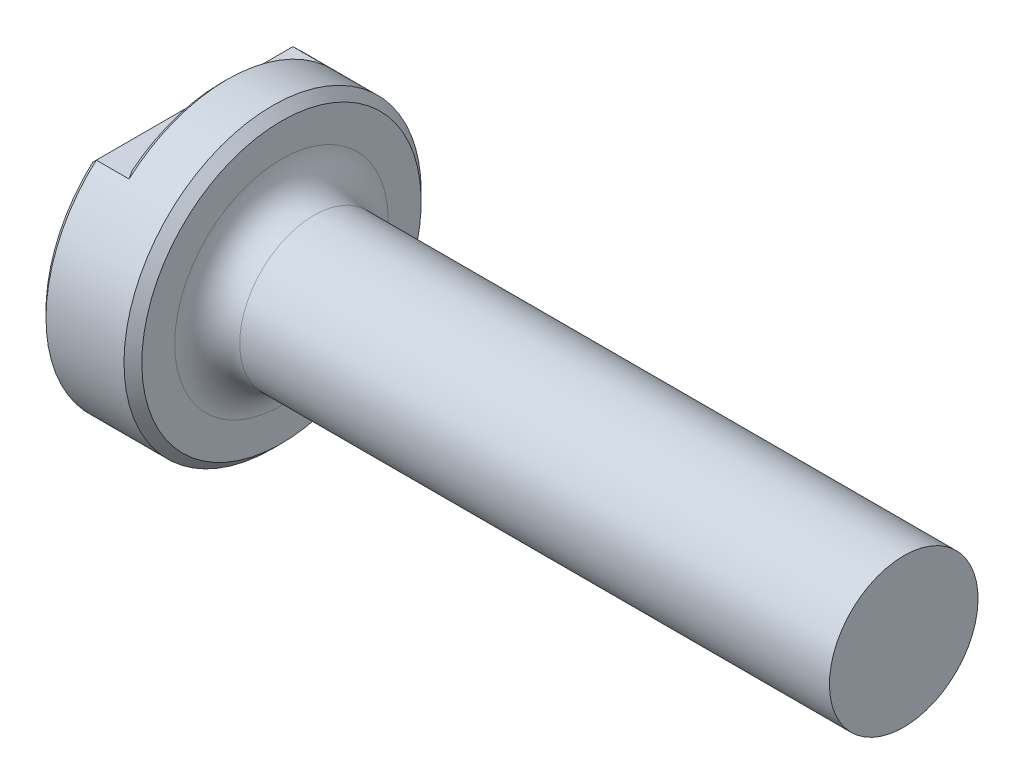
ISO-10303-21;
HEADER;
FILE_DESCRIPTION(('STEP AP214'),'2;1');
FILE_NAME('part.step','',(''),(''),'','','');
FILE_SCHEMA(('AUTOMOTIVE_DESIGN { 1 0 10303 214 1 1 1 1 }'));
ENDSEC;
DATA;
#1=APPLICATION_CONTEXT('core data for automotive mechanical design processes');
#2=APPLICATION_PROTOCOL_DEFINITION('international standard','automotive_design',2000,#1);
#3=PRODUCT_CONTEXT('',#1,'mechanical');
#4=PRODUCT('Part','Part','',(#3));
#5=PRODUCT_RELATED_PRODUCT_CATEGORY('part','',(#4));
#6=PRODUCT_DEFINITION_FORMATION('','',#4);
#7=PRODUCT_DEFINITION_CONTEXT('part definition',#1,'design');
#8=PRODUCT_DEFINITION('design','',#6,#7);
#9=PRODUCT_DEFINITION_SHAPE('','',#8);
#10=(LENGTH_UNIT() NAMED_UNIT(*) SI_UNIT(.MILLI.,.METRE.));
#11=(NAMED_UNIT(*) PLANE_ANGLE_UNIT() SI_UNIT($,.RADIAN.));
#12=(NAMED_UNIT(*) SI_UNIT($,.STERADIAN.) SOLID_ANGLE_UNIT());
#13=UNCERTAINTY_MEASURE_WITH_UNIT(LENGTH_MEASURE(1.E-05),#10,'distance_accuracy_value','');
#14=(GEOMETRIC_REPRESENTATION_CONTEXT(3) GLOBAL_UNCERTAINTY_ASSIGNED_CONTEXT((#13)) GLOBAL_UNIT_ASSIGNED_CONTEXT((#10,
#11,#12)) REPRESENTATION_CONTEXT('',''));
#15=CARTESIAN_POINT('',(0.,0.,0.));
#16=DIRECTION('',(0.,0.,1.));
#17=DIRECTION('',(1.,0.,0.));
#18=AXIS2_PLACEMENT_3D('',#15,#16,#17);
#19=CARTESIAN_POINT('',(-61.11875,0.,0.));
#20=DIRECTION('',(1.,0.,0.));
#21=DIRECTION('',(0.,0.,-1.));
#22=AXIS2_PLACEMENT_3D('',#19,#20,#21);
#23=PLANE('',#22);
#24=CARTESIAN_POINT('',(-61.11875,0.,0.));
#25=DIRECTION('',(1.,0.,0.));
#26=DIRECTION('',(0.,0.,-1.));
#27=AXIS2_PLACEMENT_3D('',#24,#25,#26);
#28=CIRCLE('',#27,24.384);
#29=CARTESIAN_POINT('',(-61.11875,18.034,-16.4120169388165));
#30=VERTEX_POINT('',#29);
#31=CARTESIAN_POINT('',(-61.11875,18.034,16.4120169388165));
#32=VERTEX_POINT('',#31);
#33=EDGE_CURVE('E52',#30,#32,#28,.F.);
#34=ORIENTED_EDGE('',*,*,#33,.T.);
#35=DIRECTION('',(0.,0.,-1.));
#36=VECTOR('',#35,1.);
#37=CARTESIAN_POINT('',(-61.11875,18.034,0.));
#38=LINE('',#37,#36);
#39=EDGE_CURVE('E126',#32,#30,#38,.T.);
#40=ORIENTED_EDGE('',*,*,#39,.T.);
#41=EDGE_LOOP('',(#34,#40));
#42=FACE_BOUND('',#41,.T.);
#43=CARTESIAN_POINT('',(-61.11875,0.,0.));
#44=DIRECTION('',(1.,0.,0.));
#45=DIRECTION('',(0.,1.,0.));
#46=AXIS2_PLACEMENT_3D('',#43,#44,#45);
#47=CIRCLE('',#46,12.4401929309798);
#48=CARTESIAN_POINT('',(-61.11875,12.4401929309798,0.));
#49=VERTEX_POINT('',#48);
#50=EDGE_CURVE('E106',#49,#49,#47,.T.);
#51=ORIENTED_EDGE('',*,*,#50,.T.);
#52=EDGE_LOOP('',(#51));
#53=FACE_BOUND('',#52,.T.);
#54=ADVANCED_FACE('F32',(#42,#53),#23,.F.);
#55=CARTESIAN_POINT('',(61.11875,0.,0.));
#56=DIRECTION('',(-1.,0.,0.));
#57=DIRECTION('',(0.,0.,1.));
#58=AXIS2_PLACEMENT_3D('',#55,#56,#57);
#59=CYLINDRICAL_SURFACE('',#58,25.4);
#60=CARTESIAN_POINT('',(-46.76775,0.,0.));
#61=DIRECTION('',(1.,0.,0.));
#62=DIRECTION('',(0.,0.,-1.));
#63=AXIS2_PLACEMENT_3D('',#60,#61,#62);
#64=CIRCLE('',#63,25.4);
#65=CARTESIAN_POINT('',(-46.76775,0.,-25.4));
#66=VERTEX_POINT('',#65);
#67=EDGE_CURVE('E97',#66,#66,#64,.F.);
#68=ORIENTED_EDGE('',*,*,#67,.T.);
#69=EDGE_LOOP('',(#68));
#70=FACE_BOUND('',#69,.T.);
#71=DIRECTION('',(-1.,0.,0.));
#72=VECTOR('',#71,1.);
#73=CARTESIAN_POINT('',(61.11875,19.05,-16.8005208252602));
#74=LINE('',#73,#72);
#75=CARTESIAN_POINT('',(-60.10275,19.05,-16.8005208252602));
#76=VERTEX_POINT('',#75);
#77=CARTESIAN_POINT('',(-54.51475,19.05,-16.8005208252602));
#78=VERTEX_POINT('',#77);
#79=EDGE_CURVE('E100',#76,#78,#74,.F.);
#80=ORIENTED_EDGE('',*,*,#79,.T.);
#81=CARTESIAN_POINT('',(-54.51475,0.,0.));
#82=DIRECTION('',(-1.,0.,0.));
#83=DIRECTION('',(0.,0.,1.));
#84=AXIS2_PLACEMENT_3D('',#81,#82,#83);
#85=CIRCLE('',#84,25.4);
#86=CARTESIAN_POINT('',(-54.51475,19.05,16.8005208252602));
#87=VERTEX_POINT('',#86);
#88=EDGE_CURVE('E86',#78,#87,#85,.F.);
#89=ORIENTED_EDGE('',*,*,#88,.T.);
#90=DIRECTION('',(-1.,0.,0.));
#91=VECTOR('',#90,1.);
#92=CARTESIAN_POINT('',(61.11875,19.05,16.8005208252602));
#93=LINE('',#92,#91);
#94=CARTESIAN_POINT('',(-60.10275,19.05,16.8005208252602));
#95=VERTEX_POINT('',#94);
#96=EDGE_CURVE('E103',#87,#95,#93,.T.);
#97=ORIENTED_EDGE('',*,*,#96,.T.);
#98=CARTESIAN_POINT('',(-60.10275,0.,0.));
#99=DIRECTION('',(1.,0.,0.));
#100=DIRECTION('',(0.,0.,-1.));
#101=AXIS2_PLACEMENT_3D('',#98,#99,#100);
#102=CIRCLE('',#101,25.4);
#103=EDGE_CURVE('E96',#95,#76,#102,.T.);
#104=ORIENTED_EDGE('',*,*,#103,.T.);
#105=EDGE_LOOP('',(#80,#89,#97,#104));
#106=FACE_BOUND('',#105,.T.);
#107=ADVANCED_FACE('F173',(#70,#106),#59,.T.);
#108=CARTESIAN_POINT('',(-55.53075,0.,0.));
#109=DIRECTION('',(-1.,0.,0.));
#110=DIRECTION('',(0.,0.,1.));
#111=AXIS2_PLACEMENT_3D('',#108,#109,#110);
#112=PLANE('',#111);
#113=DIRECTION('',(0.,0.,1.));
#114=VECTOR('',#113,1.);
#115=CARTESIAN_POINT('',(-55.53075,19.05,-25.4));
#116=LINE('',#115,#114);
#117=CARTESIAN_POINT('',(-55.53075,19.05,-15.2209380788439));
#118=VERTEX_POINT('',#117);
#119=CARTESIAN_POINT('',(-55.53075,19.05,15.2209380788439));
#120=VERTEX_POINT('',#119);
#121=EDGE_CURVE('E95',#118,#120,#116,.T.);
#122=ORIENTED_EDGE('',*,*,#121,.T.);
#123=CARTESIAN_POINT('',(-55.53075,0.,0.));
#124=DIRECTION('',(-1.,0.,0.));
#125=DIRECTION('',(0.,0.,1.));
#126=AXIS2_PLACEMENT_3D('',#123,#124,#125);
#127=CIRCLE('',#126,24.384);
#128=EDGE_CURVE('E84',#120,#118,#127,.T.);
#129=ORIENTED_EDGE('',*,*,#128,.T.);
#130=EDGE_LOOP('',(#122,#129));
#131=FACE_BOUND('',#130,.T.);
#132=ADVANCED_FACE('F94',(#131),#112,.T.);
#133=CARTESIAN_POINT('',(-55.53075,19.05,-25.4));
#134=DIRECTION('',(0.,-1.,0.));
#135=DIRECTION('',(0.,0.,-1.));
#136=AXIS2_PLACEMENT_3D('',#133,#134,#135);
#137=PLANE('',#136);
#138=ORIENTED_EDGE('',*,*,#79,.F.);
#139=DIRECTION('',(0.,0.,1.));
#140=VECTOR('',#139,1.);
#141=CARTESIAN_POINT('',(-60.10275,19.05,-25.4));
#142=LINE('',#141,#140);
#143=EDGE_CURVE('E90',#76,#95,#142,.T.);
#144=ORIENTED_EDGE('',*,*,#143,.T.);
#145=ORIENTED_EDGE('',*,*,#96,.F.);
#146=CARTESIAN_POINT('',(-54.51475,19.05,16.8005208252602));
#147=CARTESIAN_POINT('',(-54.6010969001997,19.05,16.6699759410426));
#148=CARTESIAN_POINT('',(-54.687050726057,19.05,16.5391707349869));
#149=CARTESIAN_POINT('',(-54.8581291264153,19.05,16.2770272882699));
#150=CARTESIAN_POINT('',(-54.9432537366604,19.05,16.1456890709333));
#151=CARTESIAN_POINT('',(-55.1126383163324,19.05,15.8824555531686));
#152=CARTESIAN_POINT('',(-55.1968982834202,19.05,15.7505602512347));
#153=CARTESIAN_POINT('',(-55.3645140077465,19.05,15.4861884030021));
#154=CARTESIAN_POINT('',(-55.4478697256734,19.05,15.3537118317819));
#155=CARTESIAN_POINT('',(-55.53075,19.05,15.2209380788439));
#156=B_SPLINE_CURVE_WITH_KNOTS('',3,(#146,#147,#148,#149,#150,#151,#152,#153,#154,#155),
.UNSPECIFIED.,.F.,.F.,(4,2,2,2,4),(0.,0.46955243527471,0.939084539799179,1.40861791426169,
1.87817162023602),.UNSPECIFIED.);
#157=EDGE_CURVE('E11',#87,#120,#156,.T.);
#158=ORIENTED_EDGE('',*,*,#157,.T.);
#159=ORIENTED_EDGE('',*,*,#121,.F.);
#160=CARTESIAN_POINT('',(-55.53075,19.05,-15.2209380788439));
#161=CARTESIAN_POINT('',(-55.4478697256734,19.05,-15.3537118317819));
#162=CARTESIAN_POINT('',(-55.3645140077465,19.05,-15.4861884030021));
#163=CARTESIAN_POINT('',(-55.1968982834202,19.05,-15.7505602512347));
#164=CARTESIAN_POINT('',(-55.1126383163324,19.05,-15.8824555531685));
#165=CARTESIAN_POINT('',(-54.9432537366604,19.05,-16.1456890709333));
#166=CARTESIAN_POINT('',(-54.8581291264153,19.05,-16.2770272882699));
#167=CARTESIAN_POINT('',(-54.687050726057,19.05,-16.5391707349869));
#168=CARTESIAN_POINT('',(-54.6010969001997,19.05,-16.6699759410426));
#169=CARTESIAN_POINT('',(-54.51475,19.05,-16.8005208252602));
#170=B_SPLINE_CURVE_WITH_KNOTS('',3,(#160,#161,#162,#163,#164,#165,#166,#167,#168,#169),
.UNSPECIFIED.,.F.,.F.,(4,2,2,2,4),(0.,0.46955370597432,0.939087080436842,1.40861918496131,
1.87817162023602),.UNSPECIFIED.);
#171=EDGE_CURVE('E45',#118,#78,#170,.T.);
#172=ORIENTED_EDGE('',*,*,#171,.T.);
#173=EDGE_LOOP('',(#138,#144,#145,#158,#159,#172));
#174=FACE_BOUND('',#173,.T.);
#175=ADVANCED_FACE('F99',(#174),#137,.F.);
#176=CARTESIAN_POINT('',(-45.24375,-25.4,0.));
#177=DIRECTION('',(1.,0.,0.));
#178=DIRECTION('',(0.,1.,0.));
#179=AXIS2_PLACEMENT_3D('',#176,#177,#178);
#180=PLANE('',#179);
#181=CARTESIAN_POINT('',(-45.24375,0.,0.));
#182=DIRECTION('',(1.,0.,0.));
#183=DIRECTION('',(0.,1.,0.));
#184=AXIS2_PLACEMENT_3D('',#181,#182,#183);
#185=CIRCLE('',#184,23.876);
#186=CARTESIAN_POINT('',(-45.24375,23.876,0.));
#187=VERTEX_POINT('',#186);
#188=EDGE_CURVE('E118',#187,#187,#185,.T.);
#189=ORIENTED_EDGE('',*,*,#188,.T.);
#190=EDGE_LOOP('',(#189));
#191=FACE_BOUND('',#190,.T.);
#192=CARTESIAN_POINT('',(-45.24375,0.,0.));
#193=DIRECTION('',(1.,0.,0.));
#194=DIRECTION('',(0.,1.,0.));
#195=AXIS2_PLACEMENT_3D('',#192,#193,#194);
#196=CIRCLE('',#195,18.25625);
#197=CARTESIAN_POINT('',(-45.24375,18.25625,0.));
#198=VERTEX_POINT('',#197);
#199=EDGE_CURVE('E115',#198,#198,#196,.F.);
#200=ORIENTED_EDGE('',*,*,#199,.T.);
#201=EDGE_LOOP('',(#200));
#202=FACE_BOUND('',#201,.T.);
#203=ADVANCED_FACE('F217',(#191,#202),#180,.T.);
#204=CARTESIAN_POINT('',(61.11875,0.,0.));
#205=DIRECTION('',(1.,0.,0.));
#206=DIRECTION('',(0.,1.,0.));
#207=AXIS2_PLACEMENT_3D('',#204,#205,#206);
#208=CYLINDRICAL_SURFACE('',#207,12.7);
#209=CARTESIAN_POINT('',(-39.6875,0.,0.));
#210=DIRECTION('',(1.,0.,0.));
#211=DIRECTION('',(0.,1.,0.));
#212=AXIS2_PLACEMENT_3D('',#209,#210,#211);
#213=CIRCLE('',#212,12.7);
#214=CARTESIAN_POINT('',(-39.6875,12.7,0.));
#215=VERTEX_POINT('',#214);
#216=EDGE_CURVE('E112',#215,#215,#213,.T.);
#217=ORIENTED_EDGE('',*,*,#216,.T.);
#218=EDGE_LOOP('',(#217));
#219=FACE_BOUND('',#218,.T.);
#220=CARTESIAN_POINT('',(61.11875,0.,0.));
#221=DIRECTION('',(1.,0.,0.));
#222=DIRECTION('',(0.,1.,0.));
#223=AXIS2_PLACEMENT_3D('',#220,#221,#222);
#224=CIRCLE('',#223,12.7);
#225=CARTESIAN_POINT('',(61.11875,12.7,0.));
#226=VERTEX_POINT('',#225);
#227=EDGE_CURVE('E101',#226,#226,#224,.T.);
#228=ORIENTED_EDGE('',*,*,#227,.F.);
#229=EDGE_LOOP('',(#228));
#230=FACE_BOUND('',#229,.T.);
#231=ADVANCED_FACE('F169',(#219,#230),#208,.T.);
#232=CARTESIAN_POINT('',(61.11875,0.,0.));
#233=DIRECTION('',(1.,0.,0.));
#234=DIRECTION('',(0.,0.,-1.));
#235=AXIS2_PLACEMENT_3D('',#232,#233,#234);
#236=PLANE('',#235);
#237=ORIENTED_EDGE('',*,*,#227,.T.);
#238=EDGE_LOOP('',(#237));
#239=FACE_BOUND('',#238,.T.);
#240=ADVANCED_FACE('F162',(#239),#236,.T.);
#241=CARTESIAN_POINT('',(-75.54595,0.,0.));
#242=DIRECTION('',(1.,0.,0.));
#243=DIRECTION('',(0.,1.,0.));
#244=AXIS2_PLACEMENT_3D('',#241,#242,#243);
#245=SPHERICAL_SURFACE('',#244,19.05);
#246=ORIENTED_EDGE('',*,*,#50,.F.);
#247=EDGE_LOOP('',(#246));
#248=FACE_BOUND('',#247,.T.);
#249=ADVANCED_FACE('F159',(#248),#245,.F.);
#250=CARTESIAN_POINT('',(-39.6875,0.,0.));
#251=DIRECTION('',(1.,0.,0.));
#252=DIRECTION('',(0.,1.,0.));
#253=AXIS2_PLACEMENT_3D('',#250,#251,#252);
#254=TOROIDAL_SURFACE('',#253,18.25625,5.55625);
#255=ORIENTED_EDGE('',*,*,#199,.F.);
#256=EDGE_LOOP('',(#255));
#257=FACE_BOUND('',#256,.T.);
#258=ORIENTED_EDGE('',*,*,#216,.F.);
#259=EDGE_LOOP('',(#258));
#260=FACE_BOUND('',#259,.T.);
#261=ADVANCED_FACE('F161',(#257,#260),#254,.F.);
#262=CARTESIAN_POINT('',(-45.24375,0.,0.));
#263=DIRECTION('',(-1.,0.,0.));
#264=DIRECTION('',(0.,0.,1.));
#265=AXIS2_PLACEMENT_3D('',#262,#263,#264);
#266=CONICAL_SURFACE('',#265,23.876,0.785398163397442);
#267=ORIENTED_EDGE('',*,*,#67,.F.);
#268=EDGE_LOOP('',(#267));
#269=FACE_BOUND('',#268,.T.);
#270=ORIENTED_EDGE('',*,*,#188,.F.);
#271=EDGE_LOOP('',(#270));
#272=FACE_BOUND('',#271,.T.);
#273=ADVANCED_FACE('F144',(#269,#272),#266,.T.);
#274=CARTESIAN_POINT('',(-55.53075,0.,0.));
#275=DIRECTION('',(1.,0.,0.));
#276=DIRECTION('',(0.,0.,-1.));
#277=AXIS2_PLACEMENT_3D('',#274,#275,#276);
#278=CONICAL_SURFACE('',#277,24.384,0.785398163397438);
#279=ORIENTED_EDGE('',*,*,#157,.F.);
#280=ORIENTED_EDGE('',*,*,#88,.F.);
#281=ORIENTED_EDGE('',*,*,#171,.F.);
#282=ORIENTED_EDGE('',*,*,#128,.F.);
#283=EDGE_LOOP('',(#279,#280,#281,#282));
#284=FACE_BOUND('',#283,.T.);
#285=ADVANCED_FACE('F83',(#284),#278,.T.);
#286=CARTESIAN_POINT('',(-60.10275,0.,0.));
#287=DIRECTION('',(1.,0.,0.));
#288=DIRECTION('',(0.,0.,-1.));
#289=AXIS2_PLACEMENT_3D('',#286,#287,#288);
#290=CONICAL_SURFACE('',#289,25.4,0.78539816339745);
#291=CARTESIAN_POINT('',(-61.11875,18.034,-16.4120169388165));
#292=CARTESIAN_POINT('',(-60.949551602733,18.203198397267,-16.4774733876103));
#293=CARTESIAN_POINT('',(-60.7802857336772,18.3724642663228,-16.5425769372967));
#294=CARTESIAN_POINT('',(-60.4416190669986,18.7111309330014,-16.6720782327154));
#295=CARTESIAN_POINT('',(-60.2722182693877,18.8805317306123,-16.7364759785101));
#296=CARTESIAN_POINT('',(-60.10275,19.05,-16.8005208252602));
#297=B_SPLINE_CURVE_WITH_KNOTS('',3,(#291,#292,#293,#294,#295,#296),.UNSPECIFIED.,.F.,.F.,(4,2,
4),(0.,0.744219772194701,1.48843947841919),.UNSPECIFIED.);
#298=EDGE_CURVE('E60',#76,#30,#297,.F.);
#299=ORIENTED_EDGE('',*,*,#298,.F.);
#300=ORIENTED_EDGE('',*,*,#103,.F.);
#301=CARTESIAN_POINT('',(-60.10275,19.05,16.8005208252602));
#302=CARTESIAN_POINT('',(-60.2722182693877,18.8805317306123,16.7364759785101));
#303=CARTESIAN_POINT('',(-60.4416190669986,18.7111309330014,16.6720782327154));
#304=CARTESIAN_POINT('',(-60.7802857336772,18.3724642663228,16.5425769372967));
#305=CARTESIAN_POINT('',(-60.949551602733,18.203198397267,16.4774733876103));
#306=CARTESIAN_POINT('',(-61.11875,18.034,16.4120169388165));
#307=B_SPLINE_CURVE_WITH_KNOTS('',3,(#301,#302,#303,#304,#305,#306),.UNSPECIFIED.,.F.,.F.,(4,2,
4),(0.,0.744219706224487,1.48843947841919),.UNSPECIFIED.);
#308=EDGE_CURVE('E37',#32,#95,#307,.F.);
#309=ORIENTED_EDGE('',*,*,#308,.F.);
#310=ORIENTED_EDGE('',*,*,#33,.F.);
#311=EDGE_LOOP('',(#299,#300,#309,#310));
#312=FACE_BOUND('',#311,.T.);
#313=ADVANCED_FACE('F143',(#312),#290,.T.);
#314=CARTESIAN_POINT('',(-61.11875,18.034,0.));
#315=DIRECTION('',(0.707106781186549,-0.707106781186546,0.));
#316=DIRECTION('',(0.,0.,-1.));
#317=AXIS2_PLACEMENT_3D('',#314,#315,#316);
#318=PLANE('',#317);
#319=ORIENTED_EDGE('',*,*,#308,.T.);
#320=ORIENTED_EDGE('',*,*,#143,.F.);
#321=ORIENTED_EDGE('',*,*,#298,.T.);
#322=ORIENTED_EDGE('',*,*,#39,.F.);
#323=EDGE_LOOP('',(#319,#320,#321,#322));
#324=FACE_BOUND('',#323,.T.);
#325=ADVANCED_FACE('F34',(#324),#318,.F.);
#326=CLOSED_SHELL('',(#54,#107,#132,#175,#203,#231,#240,#249,#261,#273,#285,#313,#325));
#327=MANIFOLD_SOLID_BREP('B2',#326);
#328=ADVANCED_BREP_SHAPE_REPRESENTATION('',(#18,#327),#14);
#329=SHAPE_DEFINITION_REPRESENTATION(#9,#328);
ENDSEC;
END-ISO-10303-21;
